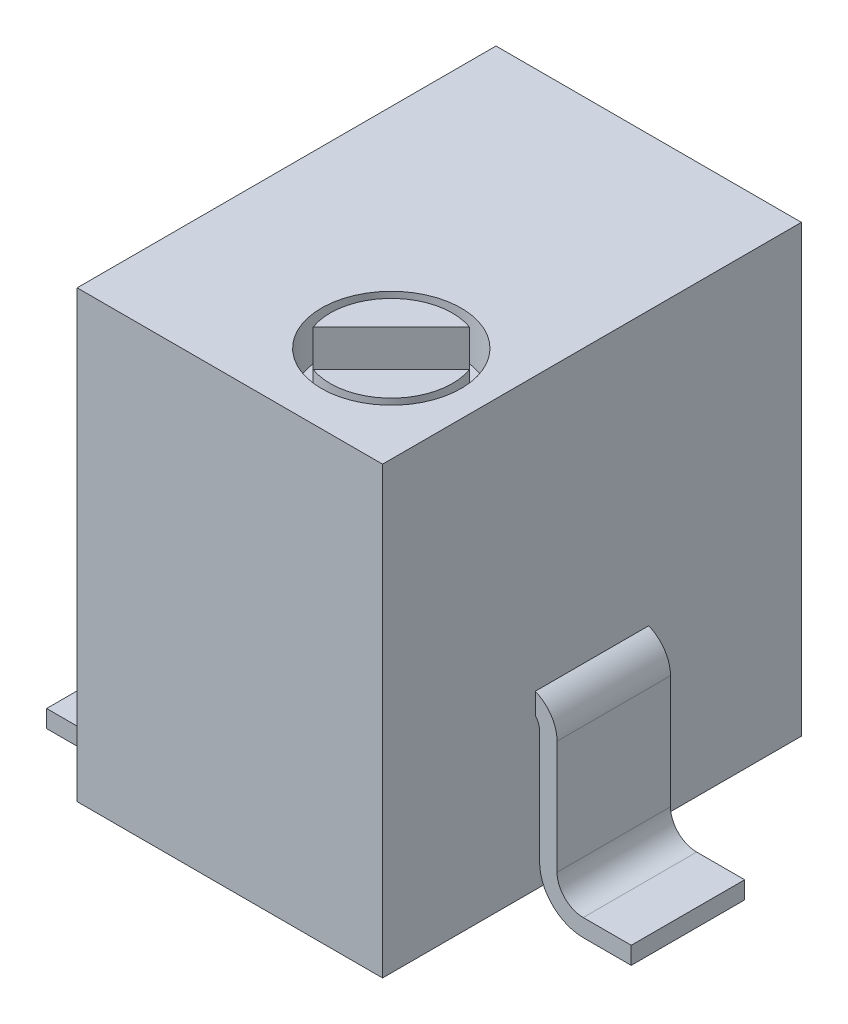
ISO-10303-21;
HEADER;
FILE_DESCRIPTION(('STEP AP214'),'2;1');
FILE_NAME('part.step','',(''),(''),'','','');
FILE_SCHEMA(('AUTOMOTIVE_DESIGN { 1 0 10303 214 1 1 1 1 }'));
ENDSEC;
DATA;
#1=APPLICATION_CONTEXT('core data for automotive mechanical design processes');
#2=APPLICATION_PROTOCOL_DEFINITION('international standard','automotive_design',2000,#1);
#3=PRODUCT_CONTEXT('',#1,'mechanical');
#4=PRODUCT('Part','Part','',(#3));
#5=PRODUCT_RELATED_PRODUCT_CATEGORY('part','',(#4));
#6=PRODUCT_DEFINITION_FORMATION('','',#4);
#7=PRODUCT_DEFINITION_CONTEXT('part definition',#1,'design');
#8=PRODUCT_DEFINITION('design','',#6,#7);
#9=PRODUCT_DEFINITION_SHAPE('','',#8);
#10=(LENGTH_UNIT() NAMED_UNIT(*) SI_UNIT(.MILLI.,.METRE.));
#11=(NAMED_UNIT(*) PLANE_ANGLE_UNIT() SI_UNIT($,.RADIAN.));
#12=(NAMED_UNIT(*) SI_UNIT($,.STERADIAN.) SOLID_ANGLE_UNIT());
#13=UNCERTAINTY_MEASURE_WITH_UNIT(LENGTH_MEASURE(1.E-05),#10,'distance_accuracy_value','');
#14=(GEOMETRIC_REPRESENTATION_CONTEXT(3) GLOBAL_UNCERTAINTY_ASSIGNED_CONTEXT((#13)) GLOBAL_UNIT_ASSIGNED_CONTEXT((#10,
#11,#12)) REPRESENTATION_CONTEXT('',''));
#15=CARTESIAN_POINT('',(0.,0.,0.));
#16=DIRECTION('',(0.,0.,1.));
#17=DIRECTION('',(1.,0.,0.));
#18=AXIS2_PLACEMENT_3D('',#15,#16,#17);
#19=CARTESIAN_POINT('',(1.8,1.8,1.65));
#20=DIRECTION('',(1.,0.,0.));
#21=DIRECTION('',(0.,0.,-1.));
#22=AXIS2_PLACEMENT_3D('',#19,#20,#21);
#23=PLANE('',#22);
#24=DIRECTION('',(0.,-1.,0.));
#25=VECTOR('',#24,1.);
#26=CARTESIAN_POINT('',(1.8,1.8,0.65));
#27=LINE('',#26,#25);
#28=CARTESIAN_POINT('',(1.8,1.8,0.65));
#29=VERTEX_POINT('',#28);
#30=CARTESIAN_POINT('',(1.8,0.5,0.65));
#31=VERTEX_POINT('',#30);
#32=EDGE_CURVE('E326',#29,#31,#27,.T.);
#33=ORIENTED_EDGE('',*,*,#32,.F.);
#34=DIRECTION('',(0.,0.,-1.));
#35=VECTOR('',#34,1.);
#36=CARTESIAN_POINT('',(1.8,1.8,1.65));
#37=LINE('',#36,#35);
#38=CARTESIAN_POINT('',(1.8,1.8,-0.65));
#39=VERTEX_POINT('',#38);
#40=EDGE_CURVE('E530',#29,#39,#37,.T.);
#41=ORIENTED_EDGE('',*,*,#40,.T.);
#42=DIRECTION('',(0.,1.,0.));
#43=VECTOR('',#42,1.);
#44=CARTESIAN_POINT('',(1.8,1.8,-0.65));
#45=LINE('',#44,#43);
#46=CARTESIAN_POINT('',(1.8,0.5,-0.65));
#47=VERTEX_POINT('',#46);
#48=EDGE_CURVE('E347',#47,#39,#45,.T.);
#49=ORIENTED_EDGE('',*,*,#48,.F.);
#50=DIRECTION('',(0.,0.,-1.));
#51=VECTOR('',#50,1.);
#52=CARTESIAN_POINT('',(1.8,0.5,1.65));
#53=LINE('',#52,#51);
#54=EDGE_CURVE('E528',#31,#47,#53,.T.);
#55=ORIENTED_EDGE('',*,*,#54,.F.);
#56=EDGE_LOOP('',(#33,#41,#49,#55));
#57=FACE_BOUND('',#56,.T.);
#58=ADVANCED_FACE('F30',(#57),#23,.F.);
#59=CARTESIAN_POINT('',(2.3,0.5,1.65));
#60=DIRECTION('',(0.,0.,-1.));
#61=DIRECTION('',(-1.,0.,0.));
#62=AXIS2_PLACEMENT_3D('',#59,#60,#61);
#63=CYLINDRICAL_SURFACE('',#62,0.5);
#64=CARTESIAN_POINT('',(2.3,0.5,0.65));
#65=DIRECTION('',(0.,0.,1.));
#66=DIRECTION('',(1.,0.,0.));
#67=AXIS2_PLACEMENT_3D('',#64,#65,#66);
#68=CIRCLE('',#67,0.5);
#69=CARTESIAN_POINT('',(2.3,0.,0.65));
#70=VERTEX_POINT('',#69);
#71=EDGE_CURVE('E328',#31,#70,#68,.T.);
#72=ORIENTED_EDGE('',*,*,#71,.F.);
#73=ORIENTED_EDGE('',*,*,#54,.T.);
#74=CARTESIAN_POINT('',(2.3,0.5,-0.65));
#75=DIRECTION('',(0.,0.,-1.));
#76=DIRECTION('',(-1.,0.,0.));
#77=AXIS2_PLACEMENT_3D('',#74,#75,#76);
#78=CIRCLE('',#77,0.5);
#79=CARTESIAN_POINT('',(2.3,0.,-0.65));
#80=VERTEX_POINT('',#79);
#81=EDGE_CURVE('E350',#80,#47,#78,.T.);
#82=ORIENTED_EDGE('',*,*,#81,.F.);
#83=DIRECTION('',(0.,0.,-1.));
#84=VECTOR('',#83,1.);
#85=CARTESIAN_POINT('',(2.3,0.,1.65));
#86=LINE('',#85,#84);
#87=EDGE_CURVE('E526',#70,#80,#86,.T.);
#88=ORIENTED_EDGE('',*,*,#87,.F.);
#89=EDGE_LOOP('',(#72,#73,#82,#88));
#90=FACE_BOUND('',#89,.T.);
#91=ADVANCED_FACE('F615',(#90),#63,.T.);
#92=CARTESIAN_POINT('',(2.3,0.,1.65));
#93=DIRECTION('',(0.,1.,0.));
#94=DIRECTION('',(0.,0.,1.));
#95=AXIS2_PLACEMENT_3D('',#92,#93,#94);
#96=PLANE('',#95);
#97=DIRECTION('',(-1.,0.,0.));
#98=VECTOR('',#97,1.);
#99=CARTESIAN_POINT('',(2.85,0.,0.65));
#100=LINE('',#99,#98);
#101=CARTESIAN_POINT('',(2.85,0.,0.65));
#102=VERTEX_POINT('',#101);
#103=EDGE_CURVE('E316',#102,#70,#100,.T.);
#104=ORIENTED_EDGE('',*,*,#103,.T.);
#105=ORIENTED_EDGE('',*,*,#87,.T.);
#106=DIRECTION('',(1.,0.,0.));
#107=VECTOR('',#106,1.);
#108=CARTESIAN_POINT('',(2.85,0.,-0.65));
#109=LINE('',#108,#107);
#110=CARTESIAN_POINT('',(2.85,0.,-0.65));
#111=VERTEX_POINT('',#110);
#112=EDGE_CURVE('E338',#80,#111,#109,.T.);
#113=ORIENTED_EDGE('',*,*,#112,.T.);
#114=DIRECTION('',(0.,0.,-1.));
#115=VECTOR('',#114,1.);
#116=CARTESIAN_POINT('',(2.85,0.,1.65));
#117=LINE('',#116,#115);
#118=EDGE_CURVE('E524',#102,#111,#117,.T.);
#119=ORIENTED_EDGE('',*,*,#118,.F.);
#120=EDGE_LOOP('',(#104,#105,#113,#119));
#121=FACE_BOUND('',#120,.T.);
#122=ADVANCED_FACE('F621',(#121),#96,.F.);
#123=CARTESIAN_POINT('',(2.85,0.,1.65));
#124=DIRECTION('',(-1.,0.,0.));
#125=DIRECTION('',(0.,0.,1.));
#126=AXIS2_PLACEMENT_3D('',#123,#124,#125);
#127=PLANE('',#126);
#128=DIRECTION('',(0.,-1.,0.));
#129=VECTOR('',#128,1.);
#130=CARTESIAN_POINT('',(2.85,5.3,0.65));
#131=LINE('',#130,#129);
#132=CARTESIAN_POINT('',(2.85,0.2,0.65));
#133=VERTEX_POINT('',#132);
#134=EDGE_CURVE('E321',#133,#102,#131,.T.);
#135=ORIENTED_EDGE('',*,*,#134,.T.);
#136=ORIENTED_EDGE('',*,*,#118,.T.);
#137=DIRECTION('',(0.,-1.,0.));
#138=VECTOR('',#137,1.);
#139=CARTESIAN_POINT('',(2.85,5.3,-0.65));
#140=LINE('',#139,#138);
#141=CARTESIAN_POINT('',(2.85,0.2,-0.65));
#142=VERTEX_POINT('',#141);
#143=EDGE_CURVE('E341',#142,#111,#140,.T.);
#144=ORIENTED_EDGE('',*,*,#143,.F.);
#145=DIRECTION('',(0.,0.,-1.));
#146=VECTOR('',#145,1.);
#147=CARTESIAN_POINT('',(2.85,0.2,1.65));
#148=LINE('',#147,#146);
#149=EDGE_CURVE('E522',#133,#142,#148,.T.);
#150=ORIENTED_EDGE('',*,*,#149,.F.);
#151=EDGE_LOOP('',(#135,#136,#144,#150));
#152=FACE_BOUND('',#151,.T.);
#153=ADVANCED_FACE('F725',(#152),#127,.F.);
#154=CARTESIAN_POINT('',(2.3,0.2,1.65));
#155=DIRECTION('',(0.,-1.,0.));
#156=DIRECTION('',(1.,0.,0.));
#157=AXIS2_PLACEMENT_3D('',#154,#155,#156);
#158=PLANE('',#157);
#159=DIRECTION('',(-1.,0.,0.));
#160=VECTOR('',#159,1.);
#161=CARTESIAN_POINT('',(2.3,0.2,0.65));
#162=LINE('',#161,#160);
#163=CARTESIAN_POINT('',(2.3,0.2,0.65));
#164=VERTEX_POINT('',#163);
#165=EDGE_CURVE('E336',#133,#164,#162,.T.);
#166=ORIENTED_EDGE('',*,*,#165,.F.);
#167=ORIENTED_EDGE('',*,*,#149,.T.);
#168=DIRECTION('',(1.,0.,0.));
#169=VECTOR('',#168,1.);
#170=CARTESIAN_POINT('',(2.3,0.2,-0.65));
#171=LINE('',#170,#169);
#172=CARTESIAN_POINT('',(2.3,0.2,-0.65));
#173=VERTEX_POINT('',#172);
#174=EDGE_CURVE('E362',#173,#142,#171,.T.);
#175=ORIENTED_EDGE('',*,*,#174,.F.);
#176=DIRECTION('',(0.,0.,-1.));
#177=VECTOR('',#176,1.);
#178=CARTESIAN_POINT('',(2.3,0.2,1.65));
#179=LINE('',#178,#177);
#180=EDGE_CURVE('E520',#164,#173,#179,.T.);
#181=ORIENTED_EDGE('',*,*,#180,.F.);
#182=EDGE_LOOP('',(#166,#167,#175,#181));
#183=FACE_BOUND('',#182,.T.);
#184=ADVANCED_FACE('F721',(#183),#158,.F.);
#185=CARTESIAN_POINT('',(2.3,0.5,1.65));
#186=DIRECTION('',(0.,0.,-1.));
#187=DIRECTION('',(-1.,0.,0.));
#188=AXIS2_PLACEMENT_3D('',#185,#186,#187);
#189=CYLINDRICAL_SURFACE('',#188,0.3);
#190=CARTESIAN_POINT('',(2.3,0.5,0.65));
#191=DIRECTION('',(0.,0.,1.));
#192=DIRECTION('',(1.,0.,0.));
#193=AXIS2_PLACEMENT_3D('',#190,#191,#192);
#194=CIRCLE('',#193,0.3);
#195=CARTESIAN_POINT('',(2.,0.5,0.65));
#196=VERTEX_POINT('',#195);
#197=EDGE_CURVE('E334',#164,#196,#194,.F.);
#198=ORIENTED_EDGE('',*,*,#197,.F.);
#199=ORIENTED_EDGE('',*,*,#180,.T.);
#200=CARTESIAN_POINT('',(2.3,0.5,-0.65));
#201=DIRECTION('',(0.,0.,-1.));
#202=DIRECTION('',(-1.,0.,0.));
#203=AXIS2_PLACEMENT_3D('',#200,#201,#202);
#204=CIRCLE('',#203,0.3);
#205=CARTESIAN_POINT('',(2.,0.5,-0.65));
#206=VERTEX_POINT('',#205);
#207=EDGE_CURVE('E359',#206,#173,#204,.F.);
#208=ORIENTED_EDGE('',*,*,#207,.F.);
#209=DIRECTION('',(0.,0.,-1.));
#210=VECTOR('',#209,1.);
#211=CARTESIAN_POINT('',(2.,0.5,1.65));
#212=LINE('',#211,#210);
#213=EDGE_CURVE('E518',#196,#206,#212,.T.);
#214=ORIENTED_EDGE('',*,*,#213,.F.);
#215=EDGE_LOOP('',(#198,#199,#208,#214));
#216=FACE_BOUND('',#215,.T.);
#217=ADVANCED_FACE('F717',(#216),#189,.F.);
#218=CARTESIAN_POINT('',(2.,1.8,1.65));
#219=DIRECTION('',(-1.,0.,0.));
#220=DIRECTION('',(0.,0.,1.));
#221=AXIS2_PLACEMENT_3D('',#218,#219,#220);
#222=PLANE('',#221);
#223=DIRECTION('',(0.,1.,0.));
#224=VECTOR('',#223,1.);
#225=CARTESIAN_POINT('',(2.,1.8,0.65));
#226=LINE('',#225,#224);
#227=CARTESIAN_POINT('',(2.,1.8,0.65));
#228=VERTEX_POINT('',#227);
#229=EDGE_CURVE('E332',#196,#228,#226,.T.);
#230=ORIENTED_EDGE('',*,*,#229,.F.);
#231=ORIENTED_EDGE('',*,*,#213,.T.);
#232=DIRECTION('',(0.,-1.,0.));
#233=VECTOR('',#232,1.);
#234=CARTESIAN_POINT('',(2.,1.8,-0.65));
#235=LINE('',#234,#233);
#236=CARTESIAN_POINT('',(2.,1.8,-0.65));
#237=VERTEX_POINT('',#236);
#238=EDGE_CURVE('E356',#237,#206,#235,.T.);
#239=ORIENTED_EDGE('',*,*,#238,.F.);
#240=DIRECTION('',(0.,0.,-1.));
#241=VECTOR('',#240,1.);
#242=CARTESIAN_POINT('',(2.,1.8,1.65));
#243=LINE('',#242,#241);
#244=EDGE_CURVE('E516',#228,#237,#243,.T.);
#245=ORIENTED_EDGE('',*,*,#244,.F.);
#246=EDGE_LOOP('',(#230,#231,#239,#245));
#247=FACE_BOUND('',#246,.T.);
#248=ADVANCED_FACE('F713',(#247),#222,.F.);
#249=CARTESIAN_POINT('',(1.6,1.8,1.65));
#250=DIRECTION('',(0.,0.,-1.));
#251=DIRECTION('',(-1.,0.,0.));
#252=AXIS2_PLACEMENT_3D('',#249,#250,#251);
#253=CYLINDRICAL_SURFACE('',#252,0.4);
#254=CARTESIAN_POINT('',(1.6,1.8,0.65));
#255=DIRECTION('',(0.,0.,1.));
#256=DIRECTION('',(1.,0.,0.));
#257=AXIS2_PLACEMENT_3D('',#254,#255,#256);
#258=CIRCLE('',#257,0.4);
#259=CARTESIAN_POINT('',(1.75,2.17080992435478,0.65));
#260=VERTEX_POINT('',#259);
#261=EDGE_CURVE('E330',#228,#260,#258,.T.);
#262=ORIENTED_EDGE('',*,*,#261,.F.);
#263=ORIENTED_EDGE('',*,*,#244,.T.);
#264=CARTESIAN_POINT('',(1.6,1.8,-0.65));
#265=DIRECTION('',(0.,0.,-1.));
#266=DIRECTION('',(-1.,0.,0.));
#267=AXIS2_PLACEMENT_3D('',#264,#265,#266);
#268=CIRCLE('',#267,0.4);
#269=CARTESIAN_POINT('',(1.75,2.17080992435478,-0.65));
#270=VERTEX_POINT('',#269);
#271=EDGE_CURVE('E353',#270,#237,#268,.T.);
#272=ORIENTED_EDGE('',*,*,#271,.F.);
#273=DIRECTION('',(0.,0.,-1.));
#274=VECTOR('',#273,1.);
#275=CARTESIAN_POINT('',(1.75,2.17080992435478,1.65));
#276=LINE('',#275,#274);
#277=EDGE_CURVE('E437',#260,#270,#276,.T.);
#278=ORIENTED_EDGE('',*,*,#277,.F.);
#279=EDGE_LOOP('',(#262,#263,#272,#278));
#280=FACE_BOUND('',#279,.T.);
#281=ADVANCED_FACE('F631',(#280),#253,.T.);
#282=CARTESIAN_POINT('',(1.6,1.8,1.65));
#283=DIRECTION('',(0.,0.,-1.));
#284=DIRECTION('',(-1.,0.,0.));
#285=AXIS2_PLACEMENT_3D('',#282,#283,#284);
#286=CYLINDRICAL_SURFACE('',#285,0.2);
#287=CARTESIAN_POINT('',(1.6,1.8,0.65));
#288=DIRECTION('',(0.,0.,1.));
#289=DIRECTION('',(1.,0.,0.));
#290=AXIS2_PLACEMENT_3D('',#287,#288,#289);
#291=CIRCLE('',#290,0.2);
#292=CARTESIAN_POINT('',(1.75,1.93228756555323,0.65));
#293=VERTEX_POINT('',#292);
#294=EDGE_CURVE('E324',#293,#29,#291,.F.);
#295=ORIENTED_EDGE('',*,*,#294,.F.);
#296=DIRECTION('',(0.,0.,-1.));
#297=VECTOR('',#296,1.);
#298=CARTESIAN_POINT('',(1.75,1.93228756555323,1.65));
#299=LINE('',#298,#297);
#300=CARTESIAN_POINT('',(1.75,1.93228756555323,-0.65));
#301=VERTEX_POINT('',#300);
#302=EDGE_CURVE('E439',#301,#293,#299,.F.);
#303=ORIENTED_EDGE('',*,*,#302,.F.);
#304=CARTESIAN_POINT('',(1.6,1.8,-0.65));
#305=DIRECTION('',(0.,0.,-1.));
#306=DIRECTION('',(-1.,0.,0.));
#307=AXIS2_PLACEMENT_3D('',#304,#305,#306);
#308=CIRCLE('',#307,0.2);
#309=EDGE_CURVE('E11',#39,#301,#308,.F.);
#310=ORIENTED_EDGE('',*,*,#309,.F.);
#311=ORIENTED_EDGE('',*,*,#40,.F.);
#312=EDGE_LOOP('',(#295,#303,#310,#311));
#313=FACE_BOUND('',#312,.T.);
#314=ADVANCED_FACE('F627',(#313),#286,.F.);
#315=CARTESIAN_POINT('',(-1.6,1.8,1.65));
#316=DIRECTION('',(0.,0.,-1.));
#317=DIRECTION('',(-1.,0.,0.));
#318=AXIS2_PLACEMENT_3D('',#315,#316,#317);
#319=CYLINDRICAL_SURFACE('',#318,0.2);
#320=CARTESIAN_POINT('',(-1.6,1.8,0.850000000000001));
#321=DIRECTION('',(0.,0.,-1.));
#322=DIRECTION('',(-1.,0.,0.));
#323=AXIS2_PLACEMENT_3D('',#320,#321,#322);
#324=CIRCLE('',#323,0.2);
#325=CARTESIAN_POINT('',(-1.75,1.93228756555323,0.850000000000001));
#326=VERTEX_POINT('',#325);
#327=CARTESIAN_POINT('',(-1.8,1.8,0.850000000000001));
#328=VERTEX_POINT('',#327);
#329=EDGE_CURVE('E407',#326,#328,#324,.F.);
#330=ORIENTED_EDGE('',*,*,#329,.F.);
#331=DIRECTION('',(0.,0.,-1.));
#332=VECTOR('',#331,1.);
#333=CARTESIAN_POINT('',(-1.75,1.93228756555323,1.65));
#334=LINE('',#333,#332);
#335=CARTESIAN_POINT('',(-1.75,1.93228756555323,1.65));
#336=VERTEX_POINT('',#335);
#337=EDGE_CURVE('E447',#336,#326,#334,.T.);
#338=ORIENTED_EDGE('',*,*,#337,.F.);
#339=CARTESIAN_POINT('',(-1.6,1.8,1.65));
#340=DIRECTION('',(0.,0.,-1.));
#341=DIRECTION('',(-1.,0.,0.));
#342=AXIS2_PLACEMENT_3D('',#339,#340,#341);
#343=CIRCLE('',#342,0.2);
#344=CARTESIAN_POINT('',(-1.8,1.8,1.65));
#345=VERTEX_POINT('',#344);
#346=EDGE_CURVE('E489',#345,#336,#343,.T.);
#347=ORIENTED_EDGE('',*,*,#346,.F.);
#348=DIRECTION('',(0.,0.,-1.));
#349=VECTOR('',#348,1.);
#350=CARTESIAN_POINT('',(-1.8,1.8,1.65));
#351=LINE('',#350,#349);
#352=EDGE_CURVE('E533',#345,#328,#351,.T.);
#353=ORIENTED_EDGE('',*,*,#352,.T.);
#354=EDGE_LOOP('',(#330,#338,#347,#353));
#355=FACE_BOUND('',#354,.T.);
#356=ADVANCED_FACE('F630',(#355),#319,.F.);
#357=CARTESIAN_POINT('',(-1.6,1.8,-0.850000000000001));
#358=DIRECTION('',(0.,0.,1.));
#359=DIRECTION('',(1.,0.,0.));
#360=AXIS2_PLACEMENT_3D('',#357,#358,#359);
#361=CIRCLE('',#360,0.2);
#362=CARTESIAN_POINT('',(-1.8,1.8,-0.85));
#363=VERTEX_POINT('',#362);
#364=CARTESIAN_POINT('',(-1.75,1.93228756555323,-0.85));
#365=VERTEX_POINT('',#364);
#366=EDGE_CURVE('E393',#363,#365,#361,.F.);
#367=ORIENTED_EDGE('',*,*,#366,.F.);
#368=CARTESIAN_POINT('',(-1.8,1.8,-1.65));
#369=VERTEX_POINT('',#368);
#370=EDGE_CURVE('E532',#363,#369,#351,.T.);
#371=ORIENTED_EDGE('',*,*,#370,.T.);
#372=CARTESIAN_POINT('',(-1.6,1.8,-1.65));
#373=DIRECTION('',(0.,0.,-1.));
#374=DIRECTION('',(-1.,0.,0.));
#375=AXIS2_PLACEMENT_3D('',#372,#373,#374);
#376=CIRCLE('',#375,0.2);
#377=CARTESIAN_POINT('',(-1.75,1.93228756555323,-1.65));
#378=VERTEX_POINT('',#377);
#379=EDGE_CURVE('E465',#369,#378,#376,.T.);
#380=ORIENTED_EDGE('',*,*,#379,.T.);
#381=EDGE_CURVE('E446',#365,#378,#334,.T.);
#382=ORIENTED_EDGE('',*,*,#381,.F.);
#383=EDGE_LOOP('',(#367,#371,#380,#382));
#384=FACE_BOUND('',#383,.T.);
#385=ADVANCED_FACE('F561',(#384),#319,.F.);
#386=CARTESIAN_POINT('',(-1.6,1.8,1.65));
#387=DIRECTION('',(0.,0.,-1.));
#388=DIRECTION('',(-1.,0.,0.));
#389=AXIS2_PLACEMENT_3D('',#386,#387,#388);
#390=CYLINDRICAL_SURFACE('',#389,0.4);
#391=CARTESIAN_POINT('',(-1.6,1.8,0.850000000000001));
#392=DIRECTION('',(0.,0.,-1.));
#393=DIRECTION('',(-1.,0.,0.));
#394=AXIS2_PLACEMENT_3D('',#391,#392,#393);
#395=CIRCLE('',#394,0.4);
#396=CARTESIAN_POINT('',(-2.,1.8,0.850000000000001));
#397=VERTEX_POINT('',#396);
#398=CARTESIAN_POINT('',(-1.75,2.17080992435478,0.850000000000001));
#399=VERTEX_POINT('',#398);
#400=EDGE_CURVE('E401',#397,#399,#395,.T.);
#401=ORIENTED_EDGE('',*,*,#400,.F.);
#402=DIRECTION('',(0.,0.,-1.));
#403=VECTOR('',#402,1.);
#404=CARTESIAN_POINT('',(-2.,1.8,1.65));
#405=LINE('',#404,#403);
#406=CARTESIAN_POINT('',(-2.,1.8,1.65));
#407=VERTEX_POINT('',#406);
#408=EDGE_CURVE('E513',#407,#397,#405,.T.);
#409=ORIENTED_EDGE('',*,*,#408,.F.);
#410=CARTESIAN_POINT('',(-1.6,1.8,1.65));
#411=DIRECTION('',(0.,0.,1.));
#412=DIRECTION('',(-1.,0.,0.));
#413=AXIS2_PLACEMENT_3D('',#410,#411,#412);
#414=CIRCLE('',#413,0.4);
#415=CARTESIAN_POINT('',(-1.75,2.17080992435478,1.65));
#416=VERTEX_POINT('',#415);
#417=EDGE_CURVE('E492',#416,#407,#414,.T.);
#418=ORIENTED_EDGE('',*,*,#417,.F.);
#419=DIRECTION('',(0.,0.,-1.));
#420=VECTOR('',#419,1.);
#421=CARTESIAN_POINT('',(-1.75,2.17080992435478,1.65));
#422=LINE('',#421,#420);
#423=EDGE_CURVE('E442',#399,#416,#422,.F.);
#424=ORIENTED_EDGE('',*,*,#423,.F.);
#425=EDGE_LOOP('',(#401,#409,#418,#424));
#426=FACE_BOUND('',#425,.T.);
#427=ADVANCED_FACE('F680',(#426),#390,.T.);
#428=CARTESIAN_POINT('',(-1.6,1.8,-0.850000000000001));
#429=DIRECTION('',(0.,0.,1.));
#430=DIRECTION('',(1.,0.,0.));
#431=AXIS2_PLACEMENT_3D('',#428,#429,#430);
#432=CIRCLE('',#431,0.4);
#433=CARTESIAN_POINT('',(-1.75,2.17080992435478,-0.85));
#434=VERTEX_POINT('',#433);
#435=CARTESIAN_POINT('',(-2.,1.8,-0.85));
#436=VERTEX_POINT('',#435);
#437=EDGE_CURVE('E387',#434,#436,#432,.T.);
#438=ORIENTED_EDGE('',*,*,#437,.F.);
#439=CARTESIAN_POINT('',(-1.75,2.17080992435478,-1.65));
#440=VERTEX_POINT('',#439);
#441=EDGE_CURVE('E443',#440,#434,#422,.F.);
#442=ORIENTED_EDGE('',*,*,#441,.F.);
#443=CARTESIAN_POINT('',(-1.6,1.8,-1.65));
#444=DIRECTION('',(0.,0.,1.));
#445=DIRECTION('',(-1.,0.,0.));
#446=AXIS2_PLACEMENT_3D('',#443,#444,#445);
#447=CIRCLE('',#446,0.4);
#448=CARTESIAN_POINT('',(-2.,1.8,-1.65));
#449=VERTEX_POINT('',#448);
#450=EDGE_CURVE('E468',#440,#449,#447,.T.);
#451=ORIENTED_EDGE('',*,*,#450,.T.);
#452=EDGE_CURVE('E512',#436,#449,#405,.T.);
#453=ORIENTED_EDGE('',*,*,#452,.F.);
#454=EDGE_LOOP('',(#438,#442,#451,#453));
#455=FACE_BOUND('',#454,.T.);
#456=ADVANCED_FACE('F597',(#455),#390,.T.);
#457=CARTESIAN_POINT('',(-2.85,0.,1.65));
#458=DIRECTION('',(1.,0.,0.));
#459=DIRECTION('',(0.,0.,-1.));
#460=AXIS2_PLACEMENT_3D('',#457,#458,#459);
#461=PLANE('',#460);
#462=DIRECTION('',(0.,-1.,0.));
#463=VECTOR('',#462,1.);
#464=CARTESIAN_POINT('',(-2.85,5.3,0.850000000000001));
#465=LINE('',#464,#463);
#466=CARTESIAN_POINT('',(-2.85,0.2,0.850000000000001));
#467=VERTEX_POINT('',#466);
#468=CARTESIAN_POINT('',(-2.85,0.,0.850000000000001));
#469=VERTEX_POINT('',#468);
#470=EDGE_CURVE('E378',#467,#469,#465,.T.);
#471=ORIENTED_EDGE('',*,*,#470,.T.);
#472=DIRECTION('',(0.,0.,-1.));
#473=VECTOR('',#472,1.);
#474=CARTESIAN_POINT('',(-2.85,0.,1.65));
#475=LINE('',#474,#473);
#476=CARTESIAN_POINT('',(-2.85,0.,1.65));
#477=VERTEX_POINT('',#476);
#478=EDGE_CURVE('E545',#477,#469,#475,.T.);
#479=ORIENTED_EDGE('',*,*,#478,.F.);
#480=DIRECTION('',(0.,-1.,0.));
#481=VECTOR('',#480,1.);
#482=CARTESIAN_POINT('',(-2.85,0.,1.65));
#483=LINE('',#482,#481);
#484=CARTESIAN_POINT('',(-2.85,0.2,1.65));
#485=VERTEX_POINT('',#484);
#486=EDGE_CURVE('E480',#485,#477,#483,.T.);
#487=ORIENTED_EDGE('',*,*,#486,.F.);
#488=DIRECTION('',(0.,0.,-1.));
#489=VECTOR('',#488,1.);
#490=CARTESIAN_POINT('',(-2.85,0.2,1.65));
#491=LINE('',#490,#489);
#492=EDGE_CURVE('E501',#485,#467,#491,.T.);
#493=ORIENTED_EDGE('',*,*,#492,.T.);
#494=EDGE_LOOP('',(#471,#479,#487,#493));
#495=FACE_BOUND('',#494,.T.);
#496=ADVANCED_FACE('F32',(#495),#461,.F.);
#497=DIRECTION('',(0.,-1.,0.));
#498=VECTOR('',#497,1.);
#499=CARTESIAN_POINT('',(-2.85,5.3,-0.85));
#500=LINE('',#499,#498);
#501=CARTESIAN_POINT('',(-2.85,0.2,-0.85));
#502=VERTEX_POINT('',#501);
#503=CARTESIAN_POINT('',(-2.85,0.,-0.85));
#504=VERTEX_POINT('',#503);
#505=EDGE_CURVE('E371',#502,#504,#500,.T.);
#506=ORIENTED_EDGE('',*,*,#505,.F.);
#507=CARTESIAN_POINT('',(-2.85,0.2,-1.65));
#508=VERTEX_POINT('',#507);
#509=EDGE_CURVE('E500',#502,#508,#491,.T.);
#510=ORIENTED_EDGE('',*,*,#509,.T.);
#511=DIRECTION('',(0.,-1.,0.));
#512=VECTOR('',#511,1.);
#513=CARTESIAN_POINT('',(-2.85,0.,-1.65));
#514=LINE('',#513,#512);
#515=CARTESIAN_POINT('',(-2.85,0.,-1.65));
#516=VERTEX_POINT('',#515);
#517=EDGE_CURVE('E453',#508,#516,#514,.T.);
#518=ORIENTED_EDGE('',*,*,#517,.T.);
#519=EDGE_CURVE('E544',#504,#516,#475,.T.);
#520=ORIENTED_EDGE('',*,*,#519,.F.);
#521=EDGE_LOOP('',(#506,#510,#518,#520));
#522=FACE_BOUND('',#521,.T.);
#523=ADVANCED_FACE('F579',(#522),#461,.F.);
#524=CARTESIAN_POINT('',(-2.85,0.,1.65));
#525=DIRECTION('',(0.,1.,0.));
#526=DIRECTION('',(0.,0.,1.));
#527=AXIS2_PLACEMENT_3D('',#524,#525,#526);
#528=PLANE('',#527);
#529=DIRECTION('',(1.,0.,0.));
#530=VECTOR('',#529,1.);
#531=CARTESIAN_POINT('',(-2.85,0.,0.850000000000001));
#532=LINE('',#531,#530);
#533=CARTESIAN_POINT('',(-2.3,0.,0.850000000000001));
#534=VERTEX_POINT('',#533);
#535=EDGE_CURVE('E365',#469,#534,#532,.T.);
#536=ORIENTED_EDGE('',*,*,#535,.T.);
#537=DIRECTION('',(0.,0.,-1.));
#538=VECTOR('',#537,1.);
#539=CARTESIAN_POINT('',(-2.3,0.,1.65));
#540=LINE('',#539,#538);
#541=CARTESIAN_POINT('',(-2.3,0.,1.65));
#542=VERTEX_POINT('',#541);
#543=EDGE_CURVE('E541',#542,#534,#540,.T.);
#544=ORIENTED_EDGE('',*,*,#543,.F.);
#545=DIRECTION('',(1.,0.,0.));
#546=VECTOR('',#545,1.);
#547=CARTESIAN_POINT('',(-2.85,0.,1.65));
#548=LINE('',#547,#546);
#549=EDGE_CURVE('E483',#477,#542,#548,.T.);
#550=ORIENTED_EDGE('',*,*,#549,.F.);
#551=ORIENTED_EDGE('',*,*,#478,.T.);
#552=EDGE_LOOP('',(#536,#544,#550,#551));
#553=FACE_BOUND('',#552,.T.);
#554=ADVANCED_FACE('F643',(#553),#528,.F.);
#555=DIRECTION('',(-1.,0.,0.));
#556=VECTOR('',#555,1.);
#557=CARTESIAN_POINT('',(-2.85,0.,-0.85));
#558=LINE('',#557,#556);
#559=CARTESIAN_POINT('',(-2.3,0.,-0.85));
#560=VERTEX_POINT('',#559);
#561=EDGE_CURVE('E368',#560,#504,#558,.T.);
#562=ORIENTED_EDGE('',*,*,#561,.T.);
#563=ORIENTED_EDGE('',*,*,#519,.T.);
#564=DIRECTION('',(1.,0.,0.));
#565=VECTOR('',#564,1.);
#566=CARTESIAN_POINT('',(-2.85,0.,-1.65));
#567=LINE('',#566,#565);
#568=CARTESIAN_POINT('',(-2.3,0.,-1.65));
#569=VERTEX_POINT('',#568);
#570=EDGE_CURVE('E456',#516,#569,#567,.T.);
#571=ORIENTED_EDGE('',*,*,#570,.T.);
#572=EDGE_CURVE('E540',#560,#569,#540,.T.);
#573=ORIENTED_EDGE('',*,*,#572,.F.);
#574=EDGE_LOOP('',(#562,#563,#571,#573));
#575=FACE_BOUND('',#574,.T.);
#576=ADVANCED_FACE('F575',(#575),#528,.F.);
#577=CARTESIAN_POINT('',(-2.3,0.5,1.65));
#578=DIRECTION('',(0.,0.,-1.));
#579=DIRECTION('',(-1.,0.,0.));
#580=AXIS2_PLACEMENT_3D('',#577,#578,#579);
#581=CYLINDRICAL_SURFACE('',#580,0.5);
#582=CARTESIAN_POINT('',(-2.3,0.5,0.850000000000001));
#583=DIRECTION('',(0.,0.,-1.));
#584=DIRECTION('',(-1.,0.,0.));
#585=AXIS2_PLACEMENT_3D('',#582,#583,#584);
#586=CIRCLE('',#585,0.5);
#587=CARTESIAN_POINT('',(-1.8,0.5,0.850000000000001));
#588=VERTEX_POINT('',#587);
#589=EDGE_CURVE('E405',#588,#534,#586,.T.);
#590=ORIENTED_EDGE('',*,*,#589,.F.);
#591=DIRECTION('',(0.,0.,-1.));
#592=VECTOR('',#591,1.);
#593=CARTESIAN_POINT('',(-1.8,0.5,1.65));
#594=LINE('',#593,#592);
#595=CARTESIAN_POINT('',(-1.8,0.5,1.65));
#596=VERTEX_POINT('',#595);
#597=EDGE_CURVE('E537',#596,#588,#594,.T.);
#598=ORIENTED_EDGE('',*,*,#597,.F.);
#599=CARTESIAN_POINT('',(-2.3,0.5,1.65));
#600=DIRECTION('',(0.,0.,1.));
#601=DIRECTION('',(1.,0.,0.));
#602=AXIS2_PLACEMENT_3D('',#599,#600,#601);
#603=CIRCLE('',#602,0.5);
#604=EDGE_CURVE('E485',#542,#596,#603,.T.);
#605=ORIENTED_EDGE('',*,*,#604,.F.);
#606=ORIENTED_EDGE('',*,*,#543,.T.);
#607=EDGE_LOOP('',(#590,#598,#605,#606));
#608=FACE_BOUND('',#607,.T.);
#609=ADVANCED_FACE('F640',(#608),#581,.T.);
#610=CARTESIAN_POINT('',(-2.3,0.5,-0.85));
#611=DIRECTION('',(0.,0.,1.));
#612=DIRECTION('',(1.,0.,0.));
#613=AXIS2_PLACEMENT_3D('',#610,#611,#612);
#614=CIRCLE('',#613,0.5);
#615=CARTESIAN_POINT('',(-1.8,0.5,-0.85));
#616=VERTEX_POINT('',#615);
#617=EDGE_CURVE('E391',#560,#616,#614,.T.);
#618=ORIENTED_EDGE('',*,*,#617,.F.);
#619=ORIENTED_EDGE('',*,*,#572,.T.);
#620=CARTESIAN_POINT('',(-2.3,0.5,-1.65));
#621=DIRECTION('',(0.,0.,1.));
#622=DIRECTION('',(1.,0.,0.));
#623=AXIS2_PLACEMENT_3D('',#620,#621,#622);
#624=CIRCLE('',#623,0.5);
#625=CARTESIAN_POINT('',(-1.8,0.5,-1.65));
#626=VERTEX_POINT('',#625);
#627=EDGE_CURVE('E459',#569,#626,#624,.T.);
#628=ORIENTED_EDGE('',*,*,#627,.T.);
#629=EDGE_CURVE('E536',#616,#626,#594,.T.);
#630=ORIENTED_EDGE('',*,*,#629,.F.);
#631=EDGE_LOOP('',(#618,#619,#628,#630));
#632=FACE_BOUND('',#631,.T.);
#633=ADVANCED_FACE('F572',(#632),#581,.T.);
#634=CARTESIAN_POINT('',(-1.8,0.5,1.65));
#635=DIRECTION('',(-1.,0.,0.));
#636=DIRECTION('',(0.,0.,1.));
#637=AXIS2_PLACEMENT_3D('',#634,#635,#636);
#638=PLANE('',#637);
#639=DIRECTION('',(0.,-1.,0.));
#640=VECTOR('',#639,1.);
#641=CARTESIAN_POINT('',(-1.8,0.5,0.850000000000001));
#642=LINE('',#641,#640);
#643=EDGE_CURVE('E403',#328,#588,#642,.T.);
#644=ORIENTED_EDGE('',*,*,#643,.F.);
#645=ORIENTED_EDGE('',*,*,#352,.F.);
#646=DIRECTION('',(0.,1.,0.));
#647=VECTOR('',#646,1.);
#648=CARTESIAN_POINT('',(-1.8,0.5,1.65));
#649=LINE('',#648,#647);
#650=EDGE_CURVE('E487',#596,#345,#649,.T.);
#651=ORIENTED_EDGE('',*,*,#650,.F.);
#652=ORIENTED_EDGE('',*,*,#597,.T.);
#653=EDGE_LOOP('',(#644,#645,#651,#652));
#654=FACE_BOUND('',#653,.T.);
#655=ADVANCED_FACE('F636',(#654),#638,.F.);
#656=DIRECTION('',(0.,1.,0.));
#657=VECTOR('',#656,1.);
#658=CARTESIAN_POINT('',(-1.8,0.5,-0.85));
#659=LINE('',#658,#657);
#660=EDGE_CURVE('E389',#616,#363,#659,.T.);
#661=ORIENTED_EDGE('',*,*,#660,.F.);
#662=ORIENTED_EDGE('',*,*,#629,.T.);
#663=DIRECTION('',(0.,1.,0.));
#664=VECTOR('',#663,1.);
#665=CARTESIAN_POINT('',(-1.8,0.5,-1.65));
#666=LINE('',#665,#664);
#667=EDGE_CURVE('E462',#626,#369,#666,.T.);
#668=ORIENTED_EDGE('',*,*,#667,.T.);
#669=ORIENTED_EDGE('',*,*,#370,.F.);
#670=EDGE_LOOP('',(#661,#662,#668,#669));
#671=FACE_BOUND('',#670,.T.);
#672=ADVANCED_FACE('F565',(#671),#638,.F.);
#673=CARTESIAN_POINT('',(-2.,0.5,1.65));
#674=DIRECTION('',(1.,0.,0.));
#675=DIRECTION('',(0.,0.,-1.));
#676=AXIS2_PLACEMENT_3D('',#673,#674,#675);
#677=PLANE('',#676);
#678=DIRECTION('',(0.,1.,0.));
#679=VECTOR('',#678,1.);
#680=CARTESIAN_POINT('',(-2.,0.5,0.850000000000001));
#681=LINE('',#680,#679);
#682=CARTESIAN_POINT('',(-2.,0.5,0.850000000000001));
#683=VERTEX_POINT('',#682);
#684=EDGE_CURVE('E399',#683,#397,#681,.T.);
#685=ORIENTED_EDGE('',*,*,#684,.F.);
#686=DIRECTION('',(0.,0.,-1.));
#687=VECTOR('',#686,1.);
#688=CARTESIAN_POINT('',(-2.,0.5,1.65));
#689=LINE('',#688,#687);
#690=CARTESIAN_POINT('',(-2.,0.5,1.65));
#691=VERTEX_POINT('',#690);
#692=EDGE_CURVE('E509',#691,#683,#689,.T.);
#693=ORIENTED_EDGE('',*,*,#692,.F.);
#694=DIRECTION('',(0.,-1.,0.));
#695=VECTOR('',#694,1.);
#696=CARTESIAN_POINT('',(-2.,0.5,1.65));
#697=LINE('',#696,#695);
#698=EDGE_CURVE('E494',#407,#691,#697,.T.);
#699=ORIENTED_EDGE('',*,*,#698,.F.);
#700=ORIENTED_EDGE('',*,*,#408,.T.);
#701=EDGE_LOOP('',(#685,#693,#699,#700));
#702=FACE_BOUND('',#701,.T.);
#703=ADVANCED_FACE('F675',(#702),#677,.F.);
#704=DIRECTION('',(0.,-1.,0.));
#705=VECTOR('',#704,1.);
#706=CARTESIAN_POINT('',(-2.,0.5,-0.85));
#707=LINE('',#706,#705);
#708=CARTESIAN_POINT('',(-2.,0.5,-0.85));
#709=VERTEX_POINT('',#708);
#710=EDGE_CURVE('E385',#436,#709,#707,.T.);
#711=ORIENTED_EDGE('',*,*,#710,.F.);
#712=ORIENTED_EDGE('',*,*,#452,.T.);
#713=DIRECTION('',(0.,-1.,0.));
#714=VECTOR('',#713,1.);
#715=CARTESIAN_POINT('',(-2.,0.5,-1.65));
#716=LINE('',#715,#714);
#717=CARTESIAN_POINT('',(-2.,0.5,-1.65));
#718=VERTEX_POINT('',#717);
#719=EDGE_CURVE('E471',#449,#718,#716,.T.);
#720=ORIENTED_EDGE('',*,*,#719,.T.);
#721=EDGE_CURVE('E508',#709,#718,#689,.T.);
#722=ORIENTED_EDGE('',*,*,#721,.F.);
#723=EDGE_LOOP('',(#711,#712,#720,#722));
#724=FACE_BOUND('',#723,.T.);
#725=ADVANCED_FACE('F593',(#724),#677,.F.);
#726=CARTESIAN_POINT('',(-2.3,0.5,1.65));
#727=DIRECTION('',(0.,0.,-1.));
#728=DIRECTION('',(-1.,0.,0.));
#729=AXIS2_PLACEMENT_3D('',#726,#727,#728);
#730=CYLINDRICAL_SURFACE('',#729,0.3);
#731=CARTESIAN_POINT('',(-2.3,0.5,0.850000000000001));
#732=DIRECTION('',(0.,0.,-1.));
#733=DIRECTION('',(-1.,0.,0.));
#734=AXIS2_PLACEMENT_3D('',#731,#732,#733);
#735=CIRCLE('',#734,0.3);
#736=CARTESIAN_POINT('',(-2.3,0.2,0.850000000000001));
#737=VERTEX_POINT('',#736);
#738=EDGE_CURVE('E397',#737,#683,#735,.F.);
#739=ORIENTED_EDGE('',*,*,#738,.F.);
#740=DIRECTION('',(0.,0.,-1.));
#741=VECTOR('',#740,1.);
#742=CARTESIAN_POINT('',(-2.3,0.2,1.65));
#743=LINE('',#742,#741);
#744=CARTESIAN_POINT('',(-2.3,0.2,1.65));
#745=VERTEX_POINT('',#744);
#746=EDGE_CURVE('E505',#745,#737,#743,.T.);
#747=ORIENTED_EDGE('',*,*,#746,.F.);
#748=CARTESIAN_POINT('',(-2.3,0.5,1.65));
#749=DIRECTION('',(0.,0.,-1.));
#750=DIRECTION('',(1.,0.,0.));
#751=AXIS2_PLACEMENT_3D('',#748,#749,#750);
#752=CIRCLE('',#751,0.3);
#753=EDGE_CURVE('E496',#691,#745,#752,.T.);
#754=ORIENTED_EDGE('',*,*,#753,.F.);
#755=ORIENTED_EDGE('',*,*,#692,.T.);
#756=EDGE_LOOP('',(#739,#747,#754,#755));
#757=FACE_BOUND('',#756,.T.);
#758=ADVANCED_FACE('F670',(#757),#730,.F.);
#759=CARTESIAN_POINT('',(-2.3,0.5,-0.85));
#760=DIRECTION('',(0.,0.,1.));
#761=DIRECTION('',(1.,0.,0.));
#762=AXIS2_PLACEMENT_3D('',#759,#760,#761);
#763=CIRCLE('',#762,0.3);
#764=CARTESIAN_POINT('',(-2.3,0.2,-0.85));
#765=VERTEX_POINT('',#764);
#766=EDGE_CURVE('E383',#709,#765,#763,.F.);
#767=ORIENTED_EDGE('',*,*,#766,.F.);
#768=ORIENTED_EDGE('',*,*,#721,.T.);
#769=CARTESIAN_POINT('',(-2.3,0.5,-1.65));
#770=DIRECTION('',(0.,0.,-1.));
#771=DIRECTION('',(1.,0.,0.));
#772=AXIS2_PLACEMENT_3D('',#769,#770,#771);
#773=CIRCLE('',#772,0.3);
#774=CARTESIAN_POINT('',(-2.3,0.2,-1.65));
#775=VERTEX_POINT('',#774);
#776=EDGE_CURVE('E474',#718,#775,#773,.T.);
#777=ORIENTED_EDGE('',*,*,#776,.T.);
#778=EDGE_CURVE('E504',#765,#775,#743,.T.);
#779=ORIENTED_EDGE('',*,*,#778,.F.);
#780=EDGE_LOOP('',(#767,#768,#777,#779));
#781=FACE_BOUND('',#780,.T.);
#782=ADVANCED_FACE('F589',(#781),#730,.F.);
#783=CARTESIAN_POINT('',(-2.85,0.2,1.65));
#784=DIRECTION('',(0.,-1.,0.));
#785=DIRECTION('',(0.,0.,-1.));
#786=AXIS2_PLACEMENT_3D('',#783,#784,#785);
#787=PLANE('',#786);
#788=DIRECTION('',(1.,0.,0.));
#789=VECTOR('',#788,1.);
#790=CARTESIAN_POINT('',(-2.85,0.2,0.850000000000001));
#791=LINE('',#790,#789);
#792=EDGE_CURVE('E395',#467,#737,#791,.T.);
#793=ORIENTED_EDGE('',*,*,#792,.F.);
#794=ORIENTED_EDGE('',*,*,#492,.F.);
#795=DIRECTION('',(-1.,0.,0.));
#796=VECTOR('',#795,1.);
#797=CARTESIAN_POINT('',(-2.85,0.2,1.65));
#798=LINE('',#797,#796);
#799=EDGE_CURVE('E498',#745,#485,#798,.T.);
#800=ORIENTED_EDGE('',*,*,#799,.F.);
#801=ORIENTED_EDGE('',*,*,#746,.T.);
#802=EDGE_LOOP('',(#793,#794,#800,#801));
#803=FACE_BOUND('',#802,.T.);
#804=ADVANCED_FACE('F666',(#803),#787,.F.);
#805=DIRECTION('',(-1.,0.,0.));
#806=VECTOR('',#805,1.);
#807=CARTESIAN_POINT('',(-2.85,0.2,-0.85));
#808=LINE('',#807,#806);
#809=EDGE_CURVE('E381',#765,#502,#808,.T.);
#810=ORIENTED_EDGE('',*,*,#809,.F.);
#811=ORIENTED_EDGE('',*,*,#778,.T.);
#812=DIRECTION('',(-1.,0.,0.));
#813=VECTOR('',#812,1.);
#814=CARTESIAN_POINT('',(-2.85,0.2,-1.65));
#815=LINE('',#814,#813);
#816=EDGE_CURVE('E477',#775,#508,#815,.T.);
#817=ORIENTED_EDGE('',*,*,#816,.T.);
#818=ORIENTED_EDGE('',*,*,#509,.F.);
#819=EDGE_LOOP('',(#810,#811,#817,#818));
#820=FACE_BOUND('',#819,.T.);
#821=ADVANCED_FACE('F585',(#820),#787,.F.);
#822=CARTESIAN_POINT('',(-2.3,0.5,1.65));
#823=DIRECTION('',(0.,0.,1.));
#824=DIRECTION('',(1.,0.,0.));
#825=AXIS2_PLACEMENT_3D('',#822,#823,#824);
#826=PLANE('',#825);
#827=ORIENTED_EDGE('',*,*,#346,.T.);
#828=DIRECTION('',(0.,1.,0.));
#829=VECTOR('',#828,1.);
#830=CARTESIAN_POINT('',(-1.75,0.5,1.65));
#831=LINE('',#830,#829);
#832=EDGE_CURVE('E450',#336,#416,#831,.T.);
#833=ORIENTED_EDGE('',*,*,#832,.T.);
#834=ORIENTED_EDGE('',*,*,#417,.T.);
#835=ORIENTED_EDGE('',*,*,#698,.T.);
#836=ORIENTED_EDGE('',*,*,#753,.T.);
#837=ORIENTED_EDGE('',*,*,#799,.T.);
#838=ORIENTED_EDGE('',*,*,#486,.T.);
#839=ORIENTED_EDGE('',*,*,#549,.T.);
#840=ORIENTED_EDGE('',*,*,#604,.T.);
#841=ORIENTED_EDGE('',*,*,#650,.T.);
#842=EDGE_LOOP('',(#827,#833,#834,#835,#836,#837,#838,#839,#840,#841));
#843=FACE_BOUND('',#842,.T.);
#844=ADVANCED_FACE('F657',(#843),#826,.T.);
#845=CARTESIAN_POINT('',(-2.3,0.5,-1.65));
#846=DIRECTION('',(0.,0.,1.));
#847=DIRECTION('',(1.,0.,0.));
#848=AXIS2_PLACEMENT_3D('',#845,#846,#847);
#849=PLANE('',#848);
#850=DIRECTION('',(0.,1.,0.));
#851=VECTOR('',#850,1.);
#852=CARTESIAN_POINT('',(-1.75,0.5,-1.65));
#853=LINE('',#852,#851);
#854=EDGE_CURVE('E38',#378,#440,#853,.T.);
#855=ORIENTED_EDGE('',*,*,#854,.F.);
#856=ORIENTED_EDGE('',*,*,#379,.F.);
#857=ORIENTED_EDGE('',*,*,#667,.F.);
#858=ORIENTED_EDGE('',*,*,#627,.F.);
#859=ORIENTED_EDGE('',*,*,#570,.F.);
#860=ORIENTED_EDGE('',*,*,#517,.F.);
#861=ORIENTED_EDGE('',*,*,#816,.F.);
#862=ORIENTED_EDGE('',*,*,#776,.F.);
#863=ORIENTED_EDGE('',*,*,#719,.F.);
#864=ORIENTED_EDGE('',*,*,#450,.F.);
#865=EDGE_LOOP('',(#855,#856,#857,#858,#859,#860,#861,#862,#863,#864));
#866=FACE_BOUND('',#865,.T.);
#867=ADVANCED_FACE('F556',(#866),#849,.F.);
#868=CARTESIAN_POINT('',(-1.75,5.3,2.4));
#869=DIRECTION('',(1.,0.,0.));
#870=DIRECTION('',(0.,0.,-1.));
#871=AXIS2_PLACEMENT_3D('',#868,#869,#870);
#872=PLANE('',#871);
#873=ORIENTED_EDGE('',*,*,#337,.T.);
#874=DIRECTION('',(0.,-1.,0.));
#875=VECTOR('',#874,1.);
#876=CARTESIAN_POINT('',(-1.75,5.3,0.850000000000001));
#877=LINE('',#876,#875);
#878=EDGE_CURVE('E376',#399,#326,#877,.T.);
#879=ORIENTED_EDGE('',*,*,#878,.F.);
#880=ORIENTED_EDGE('',*,*,#423,.T.);
#881=ORIENTED_EDGE('',*,*,#832,.F.);
#882=EDGE_LOOP('',(#873,#879,#880,#881));
#883=FACE_BOUND('',#882,.T.);
#884=DIRECTION('',(0.,-1.,0.));
#885=VECTOR('',#884,1.);
#886=CARTESIAN_POINT('',(-1.75,5.3,-0.85));
#887=LINE('',#886,#885);
#888=EDGE_CURVE('E373',#434,#365,#887,.T.);
#889=ORIENTED_EDGE('',*,*,#888,.T.);
#890=ORIENTED_EDGE('',*,*,#381,.T.);
#891=ORIENTED_EDGE('',*,*,#854,.T.);
#892=ORIENTED_EDGE('',*,*,#441,.T.);
#893=EDGE_LOOP('',(#889,#890,#891,#892));
#894=FACE_BOUND('',#893,.T.);
#895=DIRECTION('',(0.,0.,1.));
#896=VECTOR('',#895,1.);
#897=CARTESIAN_POINT('',(-1.75,0.2,2.4));
#898=LINE('',#897,#896);
#899=CARTESIAN_POINT('',(-1.75,0.2,-2.4));
#900=VERTEX_POINT('',#899);
#901=CARTESIAN_POINT('',(-1.75,0.2,2.4));
#902=VERTEX_POINT('',#901);
#903=EDGE_CURVE('E409',#900,#902,#898,.T.);
#904=ORIENTED_EDGE('',*,*,#903,.T.);
#905=DIRECTION('',(0.,-1.,0.));
#906=VECTOR('',#905,1.);
#907=CARTESIAN_POINT('',(-1.75,5.3,2.4));
#908=LINE('',#907,#906);
#909=CARTESIAN_POINT('',(-1.75,5.3,2.4));
#910=VERTEX_POINT('',#909);
#911=EDGE_CURVE('E434',#910,#902,#908,.T.);
#912=ORIENTED_EDGE('',*,*,#911,.F.);
#913=DIRECTION('',(0.,0.,1.));
#914=VECTOR('',#913,1.);
#915=CARTESIAN_POINT('',(-1.75,5.3,2.4));
#916=LINE('',#915,#914);
#917=CARTESIAN_POINT('',(-1.75,5.3,-2.4));
#918=VERTEX_POINT('',#917);
#919=EDGE_CURVE('E417',#918,#910,#916,.T.);
#920=ORIENTED_EDGE('',*,*,#919,.F.);
#921=DIRECTION('',(0.,-1.,0.));
#922=VECTOR('',#921,1.);
#923=CARTESIAN_POINT('',(-1.75,5.3,-2.4));
#924=LINE('',#923,#922);
#925=EDGE_CURVE('E425',#918,#900,#924,.T.);
#926=ORIENTED_EDGE('',*,*,#925,.T.);
#927=EDGE_LOOP('',(#904,#912,#920,#926));
#928=FACE_BOUND('',#927,.T.);
#929=ADVANCED_FACE('F550',(#883,#894,#928),#872,.F.);
#930=CARTESIAN_POINT('',(-1.75,5.3,2.4));
#931=DIRECTION('',(0.,0.,-1.));
#932=DIRECTION('',(-1.,0.,0.));
#933=AXIS2_PLACEMENT_3D('',#930,#931,#932);
#934=PLANE('',#933);
#935=DIRECTION('',(1.,0.,0.));
#936=VECTOR('',#935,1.);
#937=CARTESIAN_POINT('',(-1.75,0.2,2.4));
#938=LINE('',#937,#936);
#939=CARTESIAN_POINT('',(1.75,0.2,2.4));
#940=VERTEX_POINT('',#939);
#941=EDGE_CURVE('E411',#902,#940,#938,.T.);
#942=ORIENTED_EDGE('',*,*,#941,.T.);
#943=DIRECTION('',(0.,-1.,0.));
#944=VECTOR('',#943,1.);
#945=CARTESIAN_POINT('',(1.75,5.3,2.4));
#946=LINE('',#945,#944);
#947=CARTESIAN_POINT('',(1.75,5.3,2.4));
#948=VERTEX_POINT('',#947);
#949=EDGE_CURVE('E431',#948,#940,#946,.T.);
#950=ORIENTED_EDGE('',*,*,#949,.F.);
#951=DIRECTION('',(1.,0.,0.));
#952=VECTOR('',#951,1.);
#953=CARTESIAN_POINT('',(-1.75,5.3,2.4));
#954=LINE('',#953,#952);
#955=EDGE_CURVE('E419',#910,#948,#954,.T.);
#956=ORIENTED_EDGE('',*,*,#955,.F.);
#957=ORIENTED_EDGE('',*,*,#911,.T.);
#958=EDGE_LOOP('',(#942,#950,#956,#957));
#959=FACE_BOUND('',#958,.T.);
#960=ADVANCED_FACE('F689',(#959),#934,.F.);
#961=CARTESIAN_POINT('',(1.75,5.3,2.4));
#962=DIRECTION('',(-1.,0.,0.));
#963=DIRECTION('',(0.,0.,1.));
#964=AXIS2_PLACEMENT_3D('',#961,#962,#963);
#965=PLANE('',#964);
#966=DIRECTION('',(0.,-1.,0.));
#967=VECTOR('',#966,1.);
#968=CARTESIAN_POINT('',(1.75,5.3,0.65));
#969=LINE('',#968,#967);
#970=EDGE_CURVE('E319',#260,#293,#969,.T.);
#971=ORIENTED_EDGE('',*,*,#970,.F.);
#972=ORIENTED_EDGE('',*,*,#277,.T.);
#973=DIRECTION('',(0.,-1.,0.));
#974=VECTOR('',#973,1.);
#975=CARTESIAN_POINT('',(1.75,5.3,-0.65));
#976=LINE('',#975,#974);
#977=EDGE_CURVE('E344',#270,#301,#976,.T.);
#978=ORIENTED_EDGE('',*,*,#977,.T.);
#979=ORIENTED_EDGE('',*,*,#302,.T.);
#980=EDGE_LOOP('',(#971,#972,#978,#979));
#981=FACE_BOUND('',#980,.T.);
#982=DIRECTION('',(0.,0.,-1.));
#983=VECTOR('',#982,1.);
#984=CARTESIAN_POINT('',(1.75,0.2,2.4));
#985=LINE('',#984,#983);
#986=CARTESIAN_POINT('',(1.75,0.2,-2.4));
#987=VERTEX_POINT('',#986);
#988=EDGE_CURVE('E413',#940,#987,#985,.T.);
#989=ORIENTED_EDGE('',*,*,#988,.T.);
#990=DIRECTION('',(0.,-1.,0.));
#991=VECTOR('',#990,1.);
#992=CARTESIAN_POINT('',(1.75,5.3,-2.4));
#993=LINE('',#992,#991);
#994=CARTESIAN_POINT('',(1.75,5.3,-2.4));
#995=VERTEX_POINT('',#994);
#996=EDGE_CURVE('E428',#995,#987,#993,.T.);
#997=ORIENTED_EDGE('',*,*,#996,.F.);
#998=DIRECTION('',(0.,0.,-1.));
#999=VECTOR('',#998,1.);
#1000=CARTESIAN_POINT('',(1.75,5.3,2.4));
#1001=LINE('',#1000,#999);
#1002=EDGE_CURVE('E421',#948,#995,#1001,.T.);
#1003=ORIENTED_EDGE('',*,*,#1002,.F.);
#1004=ORIENTED_EDGE('',*,*,#949,.T.);
#1005=EDGE_LOOP('',(#989,#997,#1003,#1004));
#1006=FACE_BOUND('',#1005,.T.);
#1007=ADVANCED_FACE('F695',(#981,#1006),#965,.F.);
#1008=CARTESIAN_POINT('',(-1.75,5.3,-2.4));
#1009=DIRECTION('',(0.,0.,1.));
#1010=DIRECTION('',(1.,0.,0.));
#1011=AXIS2_PLACEMENT_3D('',#1008,#1009,#1010);
#1012=PLANE('',#1011);
#1013=DIRECTION('',(-1.,0.,0.));
#1014=VECTOR('',#1013,1.);
#1015=CARTESIAN_POINT('',(-1.75,0.2,-2.4));
#1016=LINE('',#1015,#1014);
#1017=EDGE_CURVE('E415',#987,#900,#1016,.T.);
#1018=ORIENTED_EDGE('',*,*,#1017,.T.);
#1019=ORIENTED_EDGE('',*,*,#925,.F.);
#1020=DIRECTION('',(-1.,0.,0.));
#1021=VECTOR('',#1020,1.);
#1022=CARTESIAN_POINT('',(-1.75,5.3,-2.4));
#1023=LINE('',#1022,#1021);
#1024=EDGE_CURVE('E423',#995,#918,#1023,.T.);
#1025=ORIENTED_EDGE('',*,*,#1024,.F.);
#1026=ORIENTED_EDGE('',*,*,#996,.T.);
#1027=EDGE_LOOP('',(#1018,#1019,#1025,#1026));
#1028=FACE_BOUND('',#1027,.T.);
#1029=ADVANCED_FACE('F799',(#1028),#1012,.F.);
#1030=CARTESIAN_POINT('',(-1.75,5.3,-2.4));
#1031=DIRECTION('',(0.,-1.,0.));
#1032=DIRECTION('',(0.,0.,-1.));
#1033=AXIS2_PLACEMENT_3D('',#1030,#1031,#1032);
#1034=PLANE('',#1033);
#1035=CARTESIAN_POINT('',(0.65,5.3,1.2));
#1036=DIRECTION('',(0.,1.,0.));
#1037=DIRECTION('',(0.,0.,1.));
#1038=AXIS2_PLACEMENT_3D('',#1035,#1036,#1037);
#1039=CIRCLE('',#1038,0.8);
#1040=CARTESIAN_POINT('',(0.65,5.3,2.));
#1041=VERTEX_POINT('',#1040);
#1042=EDGE_CURVE('E309',#1041,#1041,#1039,.T.);
#1043=ORIENTED_EDGE('',*,*,#1042,.F.);
#1044=EDGE_LOOP('',(#1043));
#1045=FACE_BOUND('',#1044,.T.);
#1046=ORIENTED_EDGE('',*,*,#919,.T.);
#1047=ORIENTED_EDGE('',*,*,#955,.T.);
#1048=ORIENTED_EDGE('',*,*,#1002,.T.);
#1049=ORIENTED_EDGE('',*,*,#1024,.T.);
#1050=EDGE_LOOP('',(#1046,#1047,#1048,#1049));
#1051=FACE_BOUND('',#1050,.T.);
#1052=ADVANCED_FACE('F791',(#1045,#1051),#1034,.F.);
#1053=CARTESIAN_POINT('',(-1.75,0.2,-2.4));
#1054=DIRECTION('',(0.,-1.,0.));
#1055=DIRECTION('',(0.,0.,-1.));
#1056=AXIS2_PLACEMENT_3D('',#1053,#1054,#1055);
#1057=PLANE('',#1056);
#1058=ORIENTED_EDGE('',*,*,#903,.F.);
#1059=ORIENTED_EDGE('',*,*,#1017,.F.);
#1060=ORIENTED_EDGE('',*,*,#988,.F.);
#1061=ORIENTED_EDGE('',*,*,#941,.F.);
#1062=EDGE_LOOP('',(#1058,#1059,#1060,#1061));
#1063=FACE_BOUND('',#1062,.T.);
#1064=ADVANCED_FACE('F611',(#1063),#1057,.T.);
#1065=CARTESIAN_POINT('',(-2.85,5.3,0.850000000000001));
#1066=DIRECTION('',(0.,0.,-1.));
#1067=DIRECTION('',(-1.,0.,0.));
#1068=AXIS2_PLACEMENT_3D('',#1065,#1066,#1067);
#1069=PLANE('',#1068);
#1070=ORIENTED_EDGE('',*,*,#329,.T.);
#1071=ORIENTED_EDGE('',*,*,#643,.T.);
#1072=ORIENTED_EDGE('',*,*,#589,.T.);
#1073=ORIENTED_EDGE('',*,*,#535,.F.);
#1074=ORIENTED_EDGE('',*,*,#470,.F.);
#1075=ORIENTED_EDGE('',*,*,#792,.T.);
#1076=ORIENTED_EDGE('',*,*,#738,.T.);
#1077=ORIENTED_EDGE('',*,*,#684,.T.);
#1078=ORIENTED_EDGE('',*,*,#400,.T.);
#1079=ORIENTED_EDGE('',*,*,#878,.T.);
#1080=EDGE_LOOP('',(#1070,#1071,#1072,#1073,#1074,#1075,#1076,#1077,#1078,#1079));
#1081=FACE_BOUND('',#1080,.T.);
#1082=ADVANCED_FACE('F602',(#1081),#1069,.T.);
#1083=CARTESIAN_POINT('',(-2.85,5.3,-0.85));
#1084=DIRECTION('',(0.,0.,1.));
#1085=DIRECTION('',(1.,0.,0.));
#1086=AXIS2_PLACEMENT_3D('',#1083,#1084,#1085);
#1087=PLANE('',#1086);
#1088=ORIENTED_EDGE('',*,*,#366,.T.);
#1089=ORIENTED_EDGE('',*,*,#888,.F.);
#1090=ORIENTED_EDGE('',*,*,#437,.T.);
#1091=ORIENTED_EDGE('',*,*,#710,.T.);
#1092=ORIENTED_EDGE('',*,*,#766,.T.);
#1093=ORIENTED_EDGE('',*,*,#809,.T.);
#1094=ORIENTED_EDGE('',*,*,#505,.T.);
#1095=ORIENTED_EDGE('',*,*,#561,.F.);
#1096=ORIENTED_EDGE('',*,*,#617,.T.);
#1097=ORIENTED_EDGE('',*,*,#660,.T.);
#1098=EDGE_LOOP('',(#1088,#1089,#1090,#1091,#1092,#1093,#1094,#1095,#1096,#1097));
#1099=FACE_BOUND('',#1098,.T.);
#1100=ADVANCED_FACE('F599',(#1099),#1087,.T.);
#1101=CARTESIAN_POINT('',(2.85,5.3,-0.65));
#1102=DIRECTION('',(0.,0.,-1.));
#1103=DIRECTION('',(-1.,0.,0.));
#1104=AXIS2_PLACEMENT_3D('',#1101,#1102,#1103);
#1105=PLANE('',#1104);
#1106=ORIENTED_EDGE('',*,*,#174,.T.);
#1107=ORIENTED_EDGE('',*,*,#143,.T.);
#1108=ORIENTED_EDGE('',*,*,#112,.F.);
#1109=ORIENTED_EDGE('',*,*,#81,.T.);
#1110=ORIENTED_EDGE('',*,*,#48,.T.);
#1111=ORIENTED_EDGE('',*,*,#309,.T.);
#1112=ORIENTED_EDGE('',*,*,#977,.F.);
#1113=ORIENTED_EDGE('',*,*,#271,.T.);
#1114=ORIENTED_EDGE('',*,*,#238,.T.);
#1115=ORIENTED_EDGE('',*,*,#207,.T.);
#1116=EDGE_LOOP('',(#1106,#1107,#1108,#1109,#1110,#1111,#1112,#1113,#1114,#1115));
#1117=FACE_BOUND('',#1116,.T.);
#1118=ADVANCED_FACE('F601',(#1117),#1105,.T.);
#1119=CARTESIAN_POINT('',(2.85,5.3,0.65));
#1120=DIRECTION('',(0.,0.,1.));
#1121=DIRECTION('',(1.,0.,0.));
#1122=AXIS2_PLACEMENT_3D('',#1119,#1120,#1121);
#1123=PLANE('',#1122);
#1124=ORIENTED_EDGE('',*,*,#165,.T.);
#1125=ORIENTED_EDGE('',*,*,#197,.T.);
#1126=ORIENTED_EDGE('',*,*,#229,.T.);
#1127=ORIENTED_EDGE('',*,*,#261,.T.);
#1128=ORIENTED_EDGE('',*,*,#970,.T.);
#1129=ORIENTED_EDGE('',*,*,#294,.T.);
#1130=ORIENTED_EDGE('',*,*,#32,.T.);
#1131=ORIENTED_EDGE('',*,*,#71,.T.);
#1132=ORIENTED_EDGE('',*,*,#103,.F.);
#1133=ORIENTED_EDGE('',*,*,#134,.F.);
#1134=EDGE_LOOP('',(#1124,#1125,#1126,#1127,#1128,#1129,#1130,#1131,#1132,#1133));
#1135=FACE_BOUND('',#1134,.T.);
#1136=ADVANCED_FACE('F608',(#1135),#1123,.T.);
#1137=CARTESIAN_POINT('',(0.65,4.8,1.2));
#1138=DIRECTION('',(0.,1.,0.));
#1139=DIRECTION('',(0.,0.,1.));
#1140=AXIS2_PLACEMENT_3D('',#1137,#1138,#1139);
#1141=CYLINDRICAL_SURFACE('',#1140,0.8);
#1142=CARTESIAN_POINT('',(0.65,4.8,1.2));
#1143=DIRECTION('',(0.,1.,0.));
#1144=DIRECTION('',(0.,0.,1.));
#1145=AXIS2_PLACEMENT_3D('',#1142,#1143,#1144);
#1146=CIRCLE('',#1145,0.8);
#1147=CARTESIAN_POINT('',(0.65,4.8,2.));
#1148=VERTEX_POINT('',#1147);
#1149=EDGE_CURVE('E313',#1148,#1148,#1146,.T.);
#1150=ORIENTED_EDGE('',*,*,#1149,.F.);
#1151=EDGE_LOOP('',(#1150));
#1152=FACE_BOUND('',#1151,.T.);
#1153=ORIENTED_EDGE('',*,*,#1042,.T.);
#1154=EDGE_LOOP('',(#1153));
#1155=FACE_BOUND('',#1154,.T.);
#1156=ADVANCED_FACE('F764',(#1152,#1155),#1141,.F.);
#1157=CARTESIAN_POINT('',(0.65,4.8,1.2));
#1158=DIRECTION('',(0.,1.,0.));
#1159=DIRECTION('',(0.,0.,1.));
#1160=AXIS2_PLACEMENT_3D('',#1157,#1158,#1159);
#1161=PLANE('',#1160);
#1162=DIRECTION('',(-0.707106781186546,0.,0.707106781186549));
#1163=VECTOR('',#1162,1.);
#1164=CARTESIAN_POINT('',(0.414918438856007,4.8,1.85934562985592));
#1165=LINE('',#1164,#1163);
#1166=CARTESIAN_POINT('',(1.30934562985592,4.8,0.964918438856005));
#1167=VERTEX_POINT('',#1166);
#1168=CARTESIAN_POINT('',(0.414918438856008,4.8,1.85934562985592));
#1169=VERTEX_POINT('',#1168);
#1170=EDGE_CURVE('E279',#1167,#1169,#1165,.T.);
#1171=ORIENTED_EDGE('',*,*,#1170,.F.);
#1172=CARTESIAN_POINT('',(0.65,4.8,1.2));
#1173=DIRECTION('',(0.,1.,0.));
#1174=DIRECTION('',(0.,0.,1.));
#1175=AXIS2_PLACEMENT_3D('',#1172,#1173,#1174);
#1176=CIRCLE('',#1175,0.7);
#1177=EDGE_CURVE('E288',#1169,#1167,#1176,.T.);
#1178=ORIENTED_EDGE('',*,*,#1177,.F.);
#1179=EDGE_LOOP('',(#1171,#1178));
#1180=FACE_BOUND('',#1179,.T.);
#1181=DIRECTION('',(0.707106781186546,0.,-0.707106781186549));
#1182=VECTOR('',#1181,1.);
#1183=CARTESIAN_POINT('',(-0.00934562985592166,4.8,1.43508156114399));
#1184=LINE('',#1183,#1182);
#1185=CARTESIAN_POINT('',(-0.00934562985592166,4.8,1.43508156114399));
#1186=VERTEX_POINT('',#1185);
#1187=CARTESIAN_POINT('',(0.885081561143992,4.8,0.540654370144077));
#1188=VERTEX_POINT('',#1187);
#1189=EDGE_CURVE('E303',#1186,#1188,#1184,.T.);
#1190=ORIENTED_EDGE('',*,*,#1189,.F.);
#1191=CARTESIAN_POINT('',(0.65,4.8,1.2));
#1192=DIRECTION('',(0.,1.,0.));
#1193=DIRECTION('',(0.,0.,1.));
#1194=AXIS2_PLACEMENT_3D('',#1191,#1192,#1193);
#1195=CIRCLE('',#1194,0.7);
#1196=EDGE_CURVE('E300',#1188,#1186,#1195,.T.);
#1197=ORIENTED_EDGE('',*,*,#1196,.F.);
#1198=EDGE_LOOP('',(#1190,#1197));
#1199=FACE_BOUND('',#1198,.T.);
#1200=ORIENTED_EDGE('',*,*,#1149,.T.);
#1201=EDGE_LOOP('',(#1200));
#1202=FACE_BOUND('',#1201,.T.);
#1203=ADVANCED_FACE('F286',(#1180,#1199,#1202),#1161,.T.);
#1204=CARTESIAN_POINT('',(0.65,4.8,1.2));
#1205=DIRECTION('',(0.,1.,0.));
#1206=DIRECTION('',(0.,0.,1.));
#1207=AXIS2_PLACEMENT_3D('',#1204,#1205,#1206);
#1208=CYLINDRICAL_SURFACE('',#1207,0.7);
#1209=CARTESIAN_POINT('',(0.65,5.3,1.2));
#1210=DIRECTION('',(0.,1.,0.));
#1211=DIRECTION('',(0.,0.,1.));
#1212=AXIS2_PLACEMENT_3D('',#1209,#1210,#1211);
#1213=CIRCLE('',#1212,0.7);
#1214=CARTESIAN_POINT('',(0.885081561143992,5.3,0.540654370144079));
#1215=VERTEX_POINT('',#1214);
#1216=CARTESIAN_POINT('',(-0.00934562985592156,5.3,1.43508156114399));
#1217=VERTEX_POINT('',#1216);
#1218=EDGE_CURVE('E45',#1215,#1217,#1213,.T.);
#1219=ORIENTED_EDGE('',*,*,#1218,.F.);
#1220=DIRECTION('',(0.,1.,0.));
#1221=VECTOR('',#1220,1.);
#1222=CARTESIAN_POINT('',(0.885081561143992,4.8,0.540654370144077));
#1223=LINE('',#1222,#1221);
#1224=EDGE_CURVE('E307',#1188,#1215,#1223,.T.);
#1225=ORIENTED_EDGE('',*,*,#1224,.F.);
#1226=ORIENTED_EDGE('',*,*,#1196,.T.);
#1227=DIRECTION('',(0.,1.,0.));
#1228=VECTOR('',#1227,1.);
#1229=CARTESIAN_POINT('',(-0.00934562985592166,4.8,1.43508156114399));
#1230=LINE('',#1229,#1228);
#1231=EDGE_CURVE('E306',#1186,#1217,#1230,.T.);
#1232=ORIENTED_EDGE('',*,*,#1231,.T.);
#1233=EDGE_LOOP('',(#1219,#1225,#1226,#1232));
#1234=FACE_BOUND('',#1233,.T.);
#1235=ADVANCED_FACE('F774',(#1234),#1208,.T.);
#1236=CARTESIAN_POINT('',(-0.00934562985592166,4.8,1.43508156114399));
#1237=DIRECTION('',(0.707106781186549,0.,0.707106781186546));
#1238=DIRECTION('',(0.707106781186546,0.,-0.707106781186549));
#1239=AXIS2_PLACEMENT_3D('',#1236,#1237,#1238);
#1240=PLANE('',#1239);
#1241=DIRECTION('',(0.707106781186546,0.,-0.707106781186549));
#1242=VECTOR('',#1241,1.);
#1243=CARTESIAN_POINT('',(-0.00934562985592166,5.3,1.43508156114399));
#1244=LINE('',#1243,#1242);
#1245=EDGE_CURVE('E297',#1217,#1215,#1244,.T.);
#1246=ORIENTED_EDGE('',*,*,#1245,.F.);
#1247=ORIENTED_EDGE('',*,*,#1231,.F.);
#1248=ORIENTED_EDGE('',*,*,#1189,.T.);
#1249=ORIENTED_EDGE('',*,*,#1224,.T.);
#1250=EDGE_LOOP('',(#1246,#1247,#1248,#1249));
#1251=FACE_BOUND('',#1250,.T.);
#1252=ADVANCED_FACE('F777',(#1251),#1240,.T.);
#1253=CARTESIAN_POINT('',(0.65,4.8,1.2));
#1254=DIRECTION('',(0.,1.,0.));
#1255=DIRECTION('',(0.,0.,1.));
#1256=AXIS2_PLACEMENT_3D('',#1253,#1254,#1255);
#1257=CYLINDRICAL_SURFACE('',#1256,0.7);
#1258=CARTESIAN_POINT('',(0.65,5.3,1.2));
#1259=DIRECTION('',(0.,1.,0.));
#1260=DIRECTION('',(0.,0.,1.));
#1261=AXIS2_PLACEMENT_3D('',#1258,#1259,#1260);
#1262=CIRCLE('',#1261,0.7);
#1263=CARTESIAN_POINT('',(0.414918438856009,5.3,1.85934562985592));
#1264=VERTEX_POINT('',#1263);
#1265=CARTESIAN_POINT('',(1.30934562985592,5.3,0.964918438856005));
#1266=VERTEX_POINT('',#1265);
#1267=EDGE_CURVE('E53',#1264,#1266,#1262,.T.);
#1268=ORIENTED_EDGE('',*,*,#1267,.F.);
#1269=DIRECTION('',(0.,1.,0.));
#1270=VECTOR('',#1269,1.);
#1271=CARTESIAN_POINT('',(0.414918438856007,4.8,1.85934562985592));
#1272=LINE('',#1271,#1270);
#1273=EDGE_CURVE('E283',#1169,#1264,#1272,.T.);
#1274=ORIENTED_EDGE('',*,*,#1273,.F.);
#1275=ORIENTED_EDGE('',*,*,#1177,.T.);
#1276=DIRECTION('',(0.,1.,0.));
#1277=VECTOR('',#1276,1.);
#1278=CARTESIAN_POINT('',(1.30934562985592,4.8,0.964918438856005));
#1279=LINE('',#1278,#1277);
#1280=EDGE_CURVE('E276',#1167,#1266,#1279,.T.);
#1281=ORIENTED_EDGE('',*,*,#1280,.T.);
#1282=EDGE_LOOP('',(#1268,#1274,#1275,#1281));
#1283=FACE_BOUND('',#1282,.T.);
#1284=ADVANCED_FACE('F290',(#1283),#1257,.T.);
#1285=CARTESIAN_POINT('',(0.414918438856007,4.8,1.85934562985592));
#1286=DIRECTION('',(-0.707106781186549,0.,-0.707106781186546));
#1287=DIRECTION('',(-0.707106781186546,0.,0.707106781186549));
#1288=AXIS2_PLACEMENT_3D('',#1285,#1286,#1287);
#1289=PLANE('',#1288);
#1290=DIRECTION('',(-0.707106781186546,0.,0.707106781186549));
#1291=VECTOR('',#1290,1.);
#1292=CARTESIAN_POINT('',(0.414918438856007,5.3,1.85934562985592));
#1293=LINE('',#1292,#1291);
#1294=EDGE_CURVE('E281',#1266,#1264,#1293,.T.);
#1295=ORIENTED_EDGE('',*,*,#1294,.F.);
#1296=ORIENTED_EDGE('',*,*,#1280,.F.);
#1297=ORIENTED_EDGE('',*,*,#1170,.T.);
#1298=ORIENTED_EDGE('',*,*,#1273,.T.);
#1299=EDGE_LOOP('',(#1295,#1296,#1297,#1298));
#1300=FACE_BOUND('',#1299,.T.);
#1301=ADVANCED_FACE('F278',(#1300),#1289,.T.);
#1302=ORIENTED_EDGE('',*,*,#1218,.T.);
#1303=ORIENTED_EDGE('',*,*,#1245,.T.);
#1304=EDGE_LOOP('',(#1302,#1303));
#1305=FACE_BOUND('',#1304,.T.);
#1306=ADVANCED_FACE('F784',(#1305),#1034,.F.);
#1307=ORIENTED_EDGE('',*,*,#1267,.T.);
#1308=ORIENTED_EDGE('',*,*,#1294,.T.);
#1309=EDGE_LOOP('',(#1307,#1308));
#1310=FACE_BOUND('',#1309,.T.);
#1311=ADVANCED_FACE('F788',(#1310),#1034,.F.);
#1312=CLOSED_SHELL('',(#58,#91,#122,#153,#184,#217,#248,#281,#314,#356,#385,#427,#456,#496,#523,
#554,#576,#609,#633,#655,#672,#703,#725,#758,#782,#804,#821,#844,#867,#929,#960,#1007,#1029,
#1052,#1064,#1082,#1100,#1118,#1136,#1156,#1203,#1235,#1252,#1284,#1301,#1306,#1311));
#1313=MANIFOLD_SOLID_BREP('B2',#1312);
#1314=ADVANCED_BREP_SHAPE_REPRESENTATION('',(#18,#1313),#14);
#1315=SHAPE_DEFINITION_REPRESENTATION(#9,#1314);
ENDSEC;
END-ISO-10303-21;
